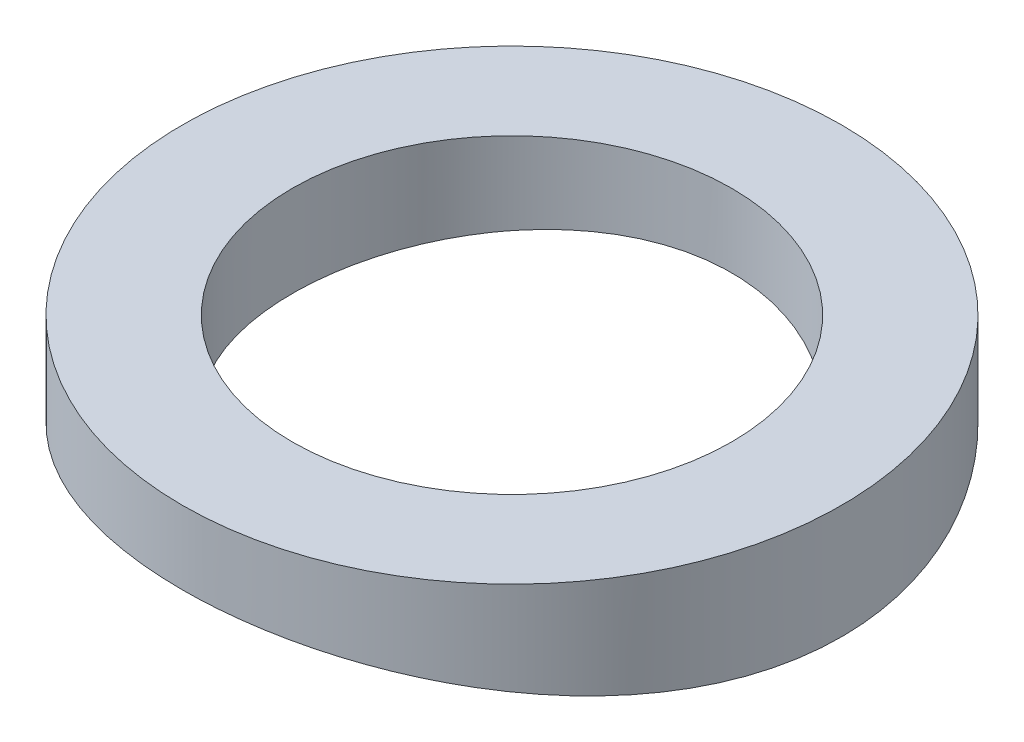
ISO-10303-21;
HEADER;
FILE_DESCRIPTION(('STEP AP214'),'2;1');
FILE_NAME('part.step','',(''),(''),'','','');
FILE_SCHEMA(('AUTOMOTIVE_DESIGN { 1 0 10303 214 1 1 1 1 }'));
ENDSEC;
DATA;
#1=APPLICATION_CONTEXT('core data for automotive mechanical design processes');
#2=APPLICATION_PROTOCOL_DEFINITION('international standard','automotive_design',2000,#1);
#3=PRODUCT_CONTEXT('',#1,'mechanical');
#4=PRODUCT('Part','Part','',(#3));
#5=PRODUCT_RELATED_PRODUCT_CATEGORY('part','',(#4));
#6=PRODUCT_DEFINITION_FORMATION('','',#4);
#7=PRODUCT_DEFINITION_CONTEXT('part definition',#1,'design');
#8=PRODUCT_DEFINITION('design','',#6,#7);
#9=PRODUCT_DEFINITION_SHAPE('','',#8);
#10=(LENGTH_UNIT() NAMED_UNIT(*) SI_UNIT(.MILLI.,.METRE.));
#11=(NAMED_UNIT(*) PLANE_ANGLE_UNIT() SI_UNIT($,.RADIAN.));
#12=(NAMED_UNIT(*) SI_UNIT($,.STERADIAN.) SOLID_ANGLE_UNIT());
#13=UNCERTAINTY_MEASURE_WITH_UNIT(LENGTH_MEASURE(1.E-05),#10,'distance_accuracy_value','');
#14=(GEOMETRIC_REPRESENTATION_CONTEXT(3) GLOBAL_UNCERTAINTY_ASSIGNED_CONTEXT((#13)) GLOBAL_UNIT_ASSIGNED_CONTEXT((#10,
#11,#12)) REPRESENTATION_CONTEXT('',''));
#15=CARTESIAN_POINT('',(0.,0.,0.));
#16=DIRECTION('',(0.,0.,1.));
#17=DIRECTION('',(1.,0.,0.));
#18=AXIS2_PLACEMENT_3D('',#15,#16,#17);
#19=CARTESIAN_POINT('',(0.,6.53689538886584,0.));
#20=DIRECTION('',(0.,1.,0.));
#21=DIRECTION('',(0.,0.,1.));
#22=AXIS2_PLACEMENT_3D('',#19,#20,#21);
#23=CYLINDRICAL_SURFACE('',#22,9.);
#24=CARTESIAN_POINT('',(0.,-1.11128311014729,9.));
#25=CARTESIAN_POINT('',(-0.248924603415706,-1.11127894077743,9.00000702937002));
#26=CARTESIAN_POINT('',(-0.497770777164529,-1.11379896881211,8.98967104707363));
#27=CARTESIAN_POINT('',(-0.993723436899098,-1.12379955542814,8.94842932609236));
#28=CARTESIAN_POINT('',(-1.24082970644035,-1.13128072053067,8.91752107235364));
#29=CARTESIAN_POINT('',(-1.73151881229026,-1.15100456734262,8.83537008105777));
#30=CARTESIAN_POINT('',(-1.97510042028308,-1.16324886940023,8.78412042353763));
#31=CARTESIAN_POINT('',(-2.457028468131,-1.19216474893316,8.66168805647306));
#32=CARTESIAN_POINT('',(-2.69537294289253,-1.20883795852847,8.59049799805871));
#33=CARTESIAN_POINT('',(-3.16470874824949,-1.24612397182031,8.42888632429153));
#34=CARTESIAN_POINT('',(-3.39571097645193,-1.2667305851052,8.338494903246));
#35=CARTESIAN_POINT('',(-3.84928101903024,-1.31135117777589,8.13906835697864));
#36=CARTESIAN_POINT('',(-4.07184563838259,-1.33536643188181,8.03002625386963));
#37=CARTESIAN_POINT('',(-4.5068961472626,-1.3861440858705,7.79417007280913));
#38=CARTESIAN_POINT('',(-4.71938621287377,-1.41290533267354,7.66736344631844));
#39=CARTESIAN_POINT('',(-5.13311775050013,-1.46848441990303,7.39677163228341));
#40=CARTESIAN_POINT('',(-5.33435402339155,-1.4973031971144,7.25297869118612));
#41=CARTESIAN_POINT('',(-5.72762824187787,-1.55674137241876,6.946759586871));
#42=CARTESIAN_POINT('',(-5.91944244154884,-1.58738351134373,6.78405042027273));
#43=CARTESIAN_POINT('',(-6.28866432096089,-1.64914206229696,6.44327467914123));
#44=CARTESIAN_POINT('',(-6.46607818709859,-1.68025826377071,6.26521476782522));
#45=CARTESIAN_POINT('',(-6.80551436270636,-1.74213741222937,5.89475362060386));
#46=CARTESIAN_POINT('',(-6.96752870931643,-1.77290016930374,5.70234505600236));
#47=CARTESIAN_POINT('',(-7.2749148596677,-1.83318857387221,5.30459826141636));
#48=CARTESIAN_POINT('',(-7.42029286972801,-1.86271468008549,5.09926489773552));
#49=CARTESIAN_POINT('',(-7.69543677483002,-1.92011988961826,4.67389888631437));
#50=CARTESIAN_POINT('',(-7.82494760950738,-1.94796914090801,4.45369710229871));
#51=CARTESIAN_POINT('',(-8.06486497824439,-2.00071620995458,4.00288943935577));
#52=CARTESIAN_POINT('',(-8.17527883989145,-2.02561515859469,3.77228759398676));
#53=CARTESIAN_POINT('',(-8.37620967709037,-2.07172504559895,3.30218962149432));
#54=CARTESIAN_POINT('',(-8.46672503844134,-2.09293568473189,3.06269277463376));
#55=CARTESIAN_POINT('',(-8.62710407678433,-2.13101245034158,2.57654531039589));
#56=CARTESIAN_POINT('',(-8.69696822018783,-2.1478786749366,2.32989485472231));
#57=CARTESIAN_POINT('',(-8.81432182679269,-2.1764627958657,1.83600776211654));
#58=CARTESIAN_POINT('',(-8.86221168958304,-2.18827253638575,1.58887155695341));
#59=CARTESIAN_POINT('',(-8.93713788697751,-2.20683963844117,1.09126923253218));
#60=CARTESIAN_POINT('',(-8.964174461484,-2.2135970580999,0.840803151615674));
#61=CARTESIAN_POINT('',(-8.99715626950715,-2.22184915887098,0.338433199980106));
#62=CARTESIAN_POINT('',(-9.00310433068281,-2.22334454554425,0.0865295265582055));
#63=CARTESIAN_POINT('',(-8.99386428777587,-2.22102776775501,-0.416863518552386));
#64=CARTESIAN_POINT('',(-8.97867645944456,-2.21721567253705,-0.668352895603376));
#65=CARTESIAN_POINT('',(-8.92789296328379,-2.20455130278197,-1.1632597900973));
#66=CARTESIAN_POINT('',(-8.89277623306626,-2.1958173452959,-1.40672966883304));
#67=CARTESIAN_POINT('',(-8.80277392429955,-2.17365218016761,-1.88986018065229));
#68=CARTESIAN_POINT('',(-8.74788121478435,-2.16021927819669,-2.12951940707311));
#69=CARTESIAN_POINT('',(-8.6187801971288,-2.12905095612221,-2.60324631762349));
#70=CARTESIAN_POINT('',(-8.54457492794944,-2.11131621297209,-2.83731487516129));
#71=CARTESIAN_POINT('',(-8.37741585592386,-2.07205076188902,-3.29833732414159));
#72=CARTESIAN_POINT('',(-8.28446122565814,-2.05051988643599,-3.52529090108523));
#73=CARTESIAN_POINT('',(-8.07951623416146,-2.00404620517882,-3.97272531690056));
#74=CARTESIAN_POINT('',(-7.96735207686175,-1.97907269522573,-4.19312334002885));
#75=CARTESIAN_POINT('',(-7.72542425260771,-1.92657454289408,-4.62372252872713));
#76=CARTESIAN_POINT('',(-7.5956601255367,-1.89904983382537,-4.83392342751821));
#77=CARTESIAN_POINT('',(-7.31941108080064,-1.8422039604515,-5.24281468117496));
#78=CARTESIAN_POINT('',(-7.17292403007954,-1.81288256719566,-5.44150356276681));
#79=CARTESIAN_POINT('',(-6.86421272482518,-1.75324008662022,-5.82609563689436));
#80=CARTESIAN_POINT('',(-6.70198817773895,-1.72291898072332,-6.01199859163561));
#81=CARTESIAN_POINT('',(-6.3582674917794,-1.66126626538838,-6.37467836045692));
#82=CARTESIAN_POINT('',(-6.1763695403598,-1.62992946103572,-6.55107371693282));
#83=CARTESIAN_POINT('',(-5.7982904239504,-1.56793190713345,-6.88795596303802));
#84=CARTESIAN_POINT('',(-5.60210933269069,-1.53727115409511,-7.04844293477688));
#85=CARTESIAN_POINT('',(-5.19674780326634,-1.4774765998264,-7.35241414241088));
#86=CARTESIAN_POINT('',(-4.98756654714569,-1.44834289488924,-7.49589730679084));
#87=CARTESIAN_POINT('',(-4.55761941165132,-1.392417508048,-7.76481778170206));
#88=CARTESIAN_POINT('',(-4.33685395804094,-1.36562574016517,-7.89025575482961));
#89=CARTESIAN_POINT('',(-3.88446992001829,-1.3150487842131,-8.12254644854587));
#90=CARTESIAN_POINT('',(-3.65281737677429,-1.2912739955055,-8.22933533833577));
#91=CARTESIAN_POINT('',(-3.18106526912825,-1.24752163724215,-8.42293321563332));
#92=CARTESIAN_POINT('',(-2.94096906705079,-1.22754257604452,-8.5097500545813));
#93=CARTESIAN_POINT('',(-2.45395754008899,-1.19194263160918,-8.6627502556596));
#94=CARTESIAN_POINT('',(-2.20704185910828,-1.17632197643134,-8.7289325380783));
#95=CARTESIAN_POINT('',(-1.70823058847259,-1.14989357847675,-8.84009252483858));
#96=CARTESIAN_POINT('',(-1.4563351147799,-1.13908572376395,-8.88507072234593));
#97=CARTESIAN_POINT('',(-0.955631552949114,-1.12279868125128,-8.95259883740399));
#98=CARTESIAN_POINT('',(-0.706897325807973,-1.11719631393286,-8.97566751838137));
#99=CARTESIAN_POINT('',(-0.208311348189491,-1.11102962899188,-9.00105056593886));
#100=CARTESIAN_POINT('',(0.0415403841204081,-1.11046522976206,-9.0033652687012));
#101=CARTESIAN_POINT('',(0.540511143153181,-1.11439010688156,-8.9872216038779));
#102=CARTESIAN_POINT('',(0.789630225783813,-1.1188789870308,-8.96876486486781));
#103=CARTESIAN_POINT('',(1.28533630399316,-1.13278407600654,-8.91123832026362));
#104=CARTESIAN_POINT('',(1.53192330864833,-1.14220026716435,-8.87216858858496));
#105=CARTESIAN_POINT('',(2.01732555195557,-1.16553087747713,-8.77444142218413));
#106=CARTESIAN_POINT('',(2.25620138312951,-1.17937979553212,-8.71606882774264));
#107=CARTESIAN_POINT('',(2.72820735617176,-1.2112443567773,-8.58004835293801));
#108=CARTESIAN_POINT('',(2.96133538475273,-1.22926150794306,-8.5023934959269));
#109=CARTESIAN_POINT('',(3.4201217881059,-1.26897355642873,-8.32844143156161));
#110=CARTESIAN_POINT('',(3.64578236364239,-1.29066735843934,-8.23214977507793));
#111=CARTESIAN_POINT('',(4.08831633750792,-1.33717271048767,-8.02157955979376));
#112=CARTESIAN_POINT('',(4.30518635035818,-1.36198544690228,-7.90729415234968));
#113=CARTESIAN_POINT('',(4.7321790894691,-1.4145050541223,-7.6595309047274));
#114=CARTESIAN_POINT('',(4.94213038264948,-1.44225308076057,-7.52576633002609));
#115=CARTESIAN_POINT('',(5.35016489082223,-1.49956083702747,-7.24138160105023));
#116=CARTESIAN_POINT('',(5.54824269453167,-1.52912138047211,-7.09075384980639));
#117=CARTESIAN_POINT('',(5.93119051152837,-1.58925471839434,-6.77368314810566));
#118=CARTESIAN_POINT('',(6.11605862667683,-1.61982765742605,-6.60723793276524));
#119=CARTESIAN_POINT('',(6.47129595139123,-1.68114707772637,-6.25971604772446));
#120=CARTESIAN_POINT('',(6.64167138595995,-1.71189347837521,-6.07864572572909));
#121=CARTESIAN_POINT('',(6.97075290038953,-1.77346135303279,-5.69853302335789));
#122=CARTESIAN_POINT('',(7.12908867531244,-1.80426747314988,-5.49916734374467));
#123=CARTESIAN_POINT('',(7.42835004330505,-1.86431210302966,-5.08766305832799));
#124=CARTESIAN_POINT('',(7.5692820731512,-1.89355119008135,-4.87552921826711));
#125=CARTESIAN_POINT('',(7.83283746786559,-1.94963458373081,-4.43976539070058));
#126=CARTESIAN_POINT('',(7.95545415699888,-1.97647801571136,-4.21613125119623));
#127=CARTESIAN_POINT('',(8.18134652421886,-2.02695179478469,-3.75905926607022));
#128=CARTESIAN_POINT('',(8.28462994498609,-2.05058342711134,-3.52562539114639));
#129=CARTESIAN_POINT('',(8.47055853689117,-2.09380538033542,-3.05188638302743));
#130=CARTESIAN_POINT('',(8.5533199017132,-2.11341833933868,-2.81162893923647));
#131=CARTESIAN_POINT('',(8.69830009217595,-2.14817507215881,-2.32467397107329));
#132=CARTESIAN_POINT('',(8.7605189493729,-2.16331885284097,-2.07797645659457));
#133=CARTESIAN_POINT('',(8.86387432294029,-2.1886639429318,-1.57999590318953));
#134=CARTESIAN_POINT('',(8.90501446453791,-2.19886610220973,-1.32871366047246));
#135=CARTESIAN_POINT('',(8.96586560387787,-2.2140096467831,-0.823412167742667));
#136=CARTESIAN_POINT('',(8.98557708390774,-2.21895115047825,-0.569392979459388));
#137=CARTESIAN_POINT('',(9.00315413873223,-2.22335629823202,-0.0674717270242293));
#138=CARTESIAN_POINT('',(9.00159885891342,-2.22296516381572,0.180408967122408));
#139=CARTESIAN_POINT('',(8.97805761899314,-2.21706869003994,0.675133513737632));
#140=CARTESIAN_POINT('',(8.95607204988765,-2.21156344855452,0.921977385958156));
#141=CARTESIAN_POINT('',(8.89185766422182,-2.19560466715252,1.41284700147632));
#142=CARTESIAN_POINT('',(8.84962934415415,-2.18515124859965,1.65687281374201));
#143=CARTESIAN_POINT('',(8.74528004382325,-2.15960780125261,2.14038456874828));
#144=CARTESIAN_POINT('',(8.68315896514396,-2.1445177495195,2.37987048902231));
#145=CARTESIAN_POINT('',(8.53992306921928,-2.11024007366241,2.85132890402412));
#146=CARTESIAN_POINT('',(8.45891551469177,-2.09107564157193,3.08333570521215));
#147=CARTESIAN_POINT('',(8.27830921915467,-2.04913969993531,3.53975331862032));
#148=CARTESIAN_POINT('',(8.17870375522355,-2.02636688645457,3.76416134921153));
#149=CARTESIAN_POINT('',(7.96165981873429,-1.9778591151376,4.20381604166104));
#150=CARTESIAN_POINT('',(7.84422307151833,-1.95212444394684,4.41906358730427));
#151=CARTESIAN_POINT('',(7.59232506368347,-1.89839619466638,4.83906698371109));
#152=CARTESIAN_POINT('',(7.45786300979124,-1.87040251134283,5.04382234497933));
#153=CARTESIAN_POINT('',(7.1692835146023,-1.81219819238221,5.4464884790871));
#154=CARTESIAN_POINT('',(7.01476174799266,-1.78194982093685,5.64410413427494));
#155=CARTESIAN_POINT('',(6.68983208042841,-1.72071466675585,6.02569055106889));
#156=CARTESIAN_POINT('',(6.51942394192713,-1.68972787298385,6.2096611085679));
#157=CARTESIAN_POINT('',(6.16380263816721,-1.62786071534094,6.56280002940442));
#158=CARTESIAN_POINT('',(5.97858592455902,-1.59698037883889,6.7319648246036));
#159=CARTESIAN_POINT('',(5.59459357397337,-1.53617815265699,7.0543151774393));
#160=CARTESIAN_POINT('',(5.39581822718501,-1.50625624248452,7.20750107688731));
#161=CARTESIAN_POINT('',(4.98247861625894,-1.44768799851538,7.49933314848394));
#162=CARTESIAN_POINT('',(4.76770214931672,-1.4190723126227,7.63768515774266));
#163=CARTESIAN_POINT('',(4.32699602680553,-1.36449564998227,7.89571321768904));
#164=CARTESIAN_POINT('',(4.10107050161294,-1.33853370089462,8.01539611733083));
#165=CARTESIAN_POINT('',(3.63964941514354,-1.29000249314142,8.23518095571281));
#166=CARTESIAN_POINT('',(3.4041582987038,-1.26743168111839,8.3352918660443));
#167=CARTESIAN_POINT('',(2.92527406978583,-1.22631869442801,8.51517655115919));
#168=CARTESIAN_POINT('',(2.68188220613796,-1.20777588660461,8.59495352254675));
#169=CARTESIAN_POINT('',(2.04026789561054,-1.16546328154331,8.77527792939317));
#170=CARTESIAN_POINT('',(1.63706266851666,-1.14526918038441,8.85940731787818));
#171=CARTESIAN_POINT('',(0.82249994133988,-1.11818298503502,8.9717606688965));
#172=CARTESIAN_POINT('',(0.411142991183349,-1.11128999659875,8.99998838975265));
#173=CARTESIAN_POINT('',(0.,-1.11128311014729,9.));
#174=B_SPLINE_CURVE_WITH_KNOTS('',3,(#24,#25,#26,#27,#28,#29,#30,#31,#32,#33,#34,#35,#36,#37,
#38,#39,#40,#41,#42,#43,#44,#45,#46,#47,#48,#49,#50,#51,#52,#53,#54,#55,#56,#57,#58,#59,#60,#61,
#62,#63,#64,#65,#66,#67,#68,#69,#70,#71,#72,#73,#74,#75,#76,#77,#78,#79,#80,#81,#82,#83,#84,#85,
#86,#87,#88,#89,#90,#91,#92,#93,#94,#95,#96,#97,#98,#99,#100,#101,#102,#103,#104,#105,#106,#107,
#108,#109,#110,#111,#112,#113,#114,#115,#116,#117,#118,#119,#120,#121,#122,#123,#124,#125,#126,
#127,#128,#129,#130,#131,#132,#133,#134,#135,#136,#137,#138,#139,#140,#141,#142,#143,#144,#145,
#146,#147,#148,#149,#150,#151,#152,#153,#154,#155,#156,#157,#158,#159,#160,#161,#162,#163,#164,
#165,#166,#167,#168,#169,#170,#171,#172,#173),.UNSPECIFIED.,.T.,.F.,(4,2,2,2,2,2,2,2,2,2,2,2,2,
2,2,2,2,2,2,2,2,2,2,2,2,2,2,2,2,2,2,2,2,2,2,2,2,2,2,2,2,2,2,2,2,2,2,2,2,2,2,2,2,2,2,2,2,2,2,2,2,
2,2,2,2,2,2,2,2,2,2,2,2,2,4),(0.,0.746411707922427,1.49291468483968,2.23967183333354,
2.98670455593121,3.73257114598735,4.47871740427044,5.2245516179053,5.97072759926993,
6.73001429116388,7.48897304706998,8.24832213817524,9.00738701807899,9.77738627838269,
10.5470894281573,11.3168549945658,12.0866031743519,12.8417065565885,13.5968012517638,
14.351794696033,15.1067782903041,15.8443427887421,16.5821735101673,17.3198881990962,
18.0576354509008,18.8024488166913,19.5472816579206,20.2922096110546,21.0371514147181,
21.8021883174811,22.5672212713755,23.3323024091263,24.0973554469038,24.8649778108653,
25.6322978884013,26.3996581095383,27.1670004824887,27.9156844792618,28.6643563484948,
29.4129695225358,30.1615800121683,30.8996030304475,31.6378934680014,32.3759643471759,
33.1143168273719,33.8649083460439,34.6158393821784,35.3668781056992,36.1175925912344,
36.8860245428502,37.6541714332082,38.4225976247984,39.1907154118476,39.954379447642,
40.7180423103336,41.481573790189,42.245088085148,42.9878524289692,43.7306025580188,
44.4733344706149,45.2160700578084,45.9546859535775,46.6935693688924,47.4323813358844,
48.1712277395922,48.928373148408,49.685529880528,50.4428685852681,51.2001910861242,
51.9704921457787,52.7405099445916,53.5101739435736,54.2797168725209,55.5126306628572,
56.7454615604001),.UNSPECIFIED.);
#175=CARTESIAN_POINT('',(0.,-1.11128311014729,9.));
#176=VERTEX_POINT('',#175);
#177=EDGE_CURVE('E10',#176,#176,#174,.T.);
#178=ORIENTED_EDGE('',*,*,#177,.F.);
#179=EDGE_LOOP('',(#178));
#180=FACE_BOUND('',#179,.T.);
#181=CARTESIAN_POINT('',(0.,0.888716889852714,0.));
#182=DIRECTION('',(0.,1.,0.));
#183=DIRECTION('',(0.,0.,1.));
#184=AXIS2_PLACEMENT_3D('',#181,#182,#183);
#185=CIRCLE('',#184,9.);
#186=CARTESIAN_POINT('',(0.,0.888716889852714,9.));
#187=VERTEX_POINT('',#186);
#188=EDGE_CURVE('E40',#187,#187,#185,.T.);
#189=ORIENTED_EDGE('',*,*,#188,.F.);
#190=EDGE_LOOP('',(#189));
#191=FACE_BOUND('',#190,.T.);
#192=ADVANCED_FACE('F28',(#180,#191),#23,.T.);
#193=CARTESIAN_POINT('',(-9.,0.888716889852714,0.));
#194=DIRECTION('',(0.,1.,0.));
#195=DIRECTION('',(0.,0.,1.));
#196=AXIS2_PLACEMENT_3D('',#193,#194,#195);
#197=PLANE('',#196);
#198=CARTESIAN_POINT('',(0.,0.888716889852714,0.));
#199=DIRECTION('',(0.,1.,0.));
#200=DIRECTION('',(0.,0.,1.));
#201=AXIS2_PLACEMENT_3D('',#198,#199,#200);
#202=CIRCLE('',#201,6.);
#203=CARTESIAN_POINT('',(0.,0.888716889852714,6.));
#204=VERTEX_POINT('',#203);
#205=EDGE_CURVE('E65',#204,#204,#202,.T.);
#206=ORIENTED_EDGE('',*,*,#205,.F.);
#207=EDGE_LOOP('',(#206));
#208=FACE_BOUND('',#207,.T.);
#209=ORIENTED_EDGE('',*,*,#188,.T.);
#210=EDGE_LOOP('',(#209));
#211=FACE_BOUND('',#210,.T.);
#212=ADVANCED_FACE('F52',(#208,#211),#197,.T.);
#213=CARTESIAN_POINT('',(0.,-38.1112831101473,-9.));
#214=DIRECTION('',(0.,0.,1.));
#215=DIRECTION('',(1.,0.,0.));
#216=AXIS2_PLACEMENT_3D('',#213,#214,#215);
#217=CYLINDRICAL_SURFACE('',#216,37.);
#218=CARTESIAN_POINT('',(0.,-1.11128311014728,6.));
#219=CARTESIAN_POINT('',(0.167392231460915,-1.1112820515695,6.0000024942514));
#220=CARTESIAN_POINT('',(0.334750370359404,-1.11242118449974,5.99299274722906));
#221=CARTESIAN_POINT('',(0.668316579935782,-1.1169436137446,5.96501112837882));
#222=CARTESIAN_POINT('',(0.834524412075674,-1.1203273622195,5.94403644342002));
#223=CARTESIAN_POINT('',(1.16465030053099,-1.12924851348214,5.88826259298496));
#224=CARTESIAN_POINT('',(1.3285668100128,-1.13478730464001,5.85345451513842));
#225=CARTESIAN_POINT('',(1.65290139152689,-1.14786515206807,5.77026465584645));
#226=CARTESIAN_POINT('',(1.81331815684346,-1.15540494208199,5.7218778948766));
#227=CARTESIAN_POINT('',(2.12927395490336,-1.17226316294,5.61196379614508));
#228=CARTESIAN_POINT('',(2.2848185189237,-1.18157948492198,5.5504520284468));
#229=CARTESIAN_POINT('',(2.59020577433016,-1.20174149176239,5.41468080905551));
#230=CARTESIAN_POINT('',(2.74004633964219,-1.21258773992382,5.34041665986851));
#231=CARTESIAN_POINT('',(3.03286316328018,-1.23550107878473,5.17973143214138));
#232=CARTESIAN_POINT('',(3.17584283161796,-1.2475675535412,5.09331647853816));
#233=CARTESIAN_POINT('',(3.45409944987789,-1.27259799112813,4.90887654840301));
#234=CARTESIAN_POINT('',(3.58937350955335,-1.28556228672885,4.81084725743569));
#235=CARTESIAN_POINT('',(3.85226397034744,-1.31213019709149,4.60308036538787));
#236=CARTESIAN_POINT('',(3.9798128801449,-1.3257379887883,4.49325789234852));
#237=CARTESIAN_POINT('',(4.22527351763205,-1.35312314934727,4.26325723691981));
#238=CARTESIAN_POINT('',(4.34318166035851,-1.36690057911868,4.14307523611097));
#239=CARTESIAN_POINT('',(4.56846227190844,-1.39422948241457,3.89325492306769));
#240=CARTESIAN_POINT('',(4.67583794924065,-1.40778102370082,3.76361951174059));
#241=CARTESIAN_POINT('',(4.87938555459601,-1.43428571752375,3.49569889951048));
#242=CARTESIAN_POINT('',(4.97555333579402,-1.44723864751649,3.35741052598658));
#243=CARTESIAN_POINT('',(5.1564528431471,-1.47224134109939,3.072399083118));
#244=CARTESIAN_POINT('',(5.24111931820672,-1.48428579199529,2.92563411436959));
#245=CARTESIAN_POINT('',(5.39780593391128,-1.50704891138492,2.62533602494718));
#246=CARTESIAN_POINT('',(5.46982135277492,-1.51776708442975,2.47180040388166));
#247=CARTESIAN_POINT('',(5.60060475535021,-1.53755464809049,2.15914613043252));
#248=CARTESIAN_POINT('',(5.65937829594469,-1.5466247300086,2.000029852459));
#249=CARTESIAN_POINT('',(5.76328751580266,-1.56285985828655,1.67729333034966));
#250=CARTESIAN_POINT('',(5.80841821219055,-1.57002420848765,1.51367146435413));
#251=CARTESIAN_POINT('',(5.92204829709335,-1.58820108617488,1.02080986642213));
#252=CARTESIAN_POINT('',(5.97008041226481,-1.59610025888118,0.68646680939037));
#253=CARTESIAN_POINT('',(6.00942525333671,-1.60255587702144,0.0145638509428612));
#254=CARTESIAN_POINT('',(6.00074177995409,-1.60111294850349,-0.322995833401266));
#255=CARTESIAN_POINT('',(5.92737549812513,-1.58913153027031,-0.98850333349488));
#256=CARTESIAN_POINT('',(5.86323897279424,-1.57868177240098,-1.31651274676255));
#257=CARTESIAN_POINT('',(5.68162374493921,-1.54999862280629,-1.95703957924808));
#258=CARTESIAN_POINT('',(5.56414330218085,-1.53176497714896,-2.26955649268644));
#259=CARTESIAN_POINT('',(5.27862242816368,-1.48947317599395,-2.87188626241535));
#260=CARTESIAN_POINT('',(5.11035382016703,-1.4653888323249,-3.16158905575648));
#261=CARTESIAN_POINT('',(4.72819385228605,-1.41412741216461,-3.70885341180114));
#262=CARTESIAN_POINT('',(4.51429900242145,-1.3869500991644,-3.96641251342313));
#263=CARTESIAN_POINT('',(4.04397512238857,-1.33217437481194,-4.44524362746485));
#264=CARTESIAN_POINT('',(3.78707697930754,-1.30457476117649,-4.66605498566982));
#265=CARTESIAN_POINT('',(3.23962880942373,-1.25235899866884,-5.06150409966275));
#266=CARTESIAN_POINT('',(2.94907858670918,-1.22774286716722,-5.23614158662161));
#267=CARTESIAN_POINT('',(2.34215029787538,-1.18423538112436,-5.53432251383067));
#268=CARTESIAN_POINT('',(2.02575261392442,-1.16534842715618,-5.65782670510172));
#269=CARTESIAN_POINT('',(1.37633145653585,-1.13546305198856,-5.84981527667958));
#270=CARTESIAN_POINT('',(1.04330930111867,-1.12446400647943,-5.91830401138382));
#271=CARTESIAN_POINT('',(0.374064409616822,-1.1116773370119,-5.99769640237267));
#272=CARTESIAN_POINT('',(0.0379185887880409,-1.10978851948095,-6.00923270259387));
#273=CARTESIAN_POINT('',(-0.631504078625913,-1.11515844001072,-5.97607731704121));
#274=CARTESIAN_POINT('',(-0.964781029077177,-1.1224168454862,-5.93138767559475));
#275=CARTESIAN_POINT('',(-1.61706192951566,-1.14520302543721,-5.78757518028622));
#276=CARTESIAN_POINT('',(-1.93613642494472,-1.16068341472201,-5.68876413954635));
#277=CARTESIAN_POINT('',(-2.55319066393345,-1.19818439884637,-5.43984504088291));
#278=CARTESIAN_POINT('',(-2.8511692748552,-1.22020534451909,-5.28973423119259));
#279=CARTESIAN_POINT('',(-3.42033076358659,-1.26859456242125,-4.94101819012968));
#280=CARTESIAN_POINT('',(-3.69126743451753,-1.29499781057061,-4.74201605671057));
#281=CARTESIAN_POINT('',(-4.19612542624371,-1.3491134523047,-4.3017129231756));
#282=CARTESIAN_POINT('',(-4.43004420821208,-1.37682593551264,-4.06040902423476));
#283=CARTESIAN_POINT('',(-4.85655977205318,-1.43076229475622,-3.53952499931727));
#284=CARTESIAN_POINT('',(-5.04873003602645,-1.45696896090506,-3.25959360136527));
#285=CARTESIAN_POINT('',(-5.38331718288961,-1.50460906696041,-2.67103796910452));
#286=CARTESIAN_POINT('',(-5.52573558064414,-1.52604265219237,-2.36241460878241));
#287=CARTESIAN_POINT('',(-5.75613753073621,-1.5615843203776,-1.72651439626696));
#288=CARTESIAN_POINT('',(-5.84433676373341,-1.57572139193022,-1.39931718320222));
#289=CARTESIAN_POINT('',(-5.9644566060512,-1.59513438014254,-0.734318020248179));
#290=CARTESIAN_POINT('',(-5.99638182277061,-1.60041102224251,-0.396516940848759));
#291=CARTESIAN_POINT('',(-6.00135924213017,-1.60123641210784,0.108268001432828));
#292=CARTESIAN_POINT('',(-5.99601020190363,-1.60035365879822,0.275305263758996));
#293=CARTESIAN_POINT('',(-5.97141333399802,-1.59632144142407,0.608308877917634));
#294=CARTESIAN_POINT('',(-5.95217072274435,-1.59317282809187,0.774275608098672));
#295=CARTESIAN_POINT('',(-5.89991810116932,-1.58469481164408,1.10401897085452));
#296=CARTESIAN_POINT('',(-5.86690316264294,-1.57936462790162,1.26779479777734));
#297=CARTESIAN_POINT('',(-5.78737396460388,-1.5666812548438,1.59189480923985));
#298=CARTESIAN_POINT('',(-5.74086457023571,-1.55932879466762,1.75222021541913));
#299=CARTESIAN_POINT('',(-5.63472515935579,-1.54281648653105,2.06824550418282));
#300=CARTESIAN_POINT('',(-5.57510425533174,-1.5336578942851,2.22394851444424));
#301=CARTESIAN_POINT('',(-5.44318333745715,-1.51379412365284,2.52971728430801));
#302=CARTESIAN_POINT('',(-5.37088787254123,-1.50308950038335,2.679785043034));
#303=CARTESIAN_POINT('',(-5.21408995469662,-1.48042808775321,2.97337729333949));
#304=CARTESIAN_POINT('',(-5.12958275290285,-1.46847081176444,3.11689921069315));
#305=CARTESIAN_POINT('',(-4.94900770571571,-1.44364585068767,3.39631922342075));
#306=CARTESIAN_POINT('',(-4.85294393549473,-1.43077848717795,3.53221998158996));
#307=CARTESIAN_POINT('',(-4.64871301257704,-1.40433297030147,3.7970718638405));
#308=CARTESIAN_POINT('',(-4.54041829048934,-1.39074829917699,3.92592398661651));
#309=CARTESIAN_POINT('',(-4.3134429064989,-1.36339516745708,4.17402304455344));
#310=CARTESIAN_POINT('',(-4.1947659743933,-1.34962677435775,4.29327339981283));
#311=CARTESIAN_POINT('',(-3.94773400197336,-1.32227871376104,4.52146959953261));
#312=CARTESIAN_POINT('',(-3.81937322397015,-1.30869916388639,4.63040924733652));
#313=CARTESIAN_POINT('',(-3.55396508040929,-1.28212198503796,4.83710796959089));
#314=CARTESIAN_POINT('',(-3.41692093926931,-1.26912414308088,4.93487115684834));
#315=CARTESIAN_POINT('',(-3.13406955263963,-1.24398186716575,5.11920885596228));
#316=CARTESIAN_POINT('',(-2.98820839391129,-1.23184393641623,5.20570156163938));
#317=CARTESIAN_POINT('',(-2.68966579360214,-1.208869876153,5.36604118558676));
#318=CARTESIAN_POINT('',(-2.53698688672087,-1.19803326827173,5.43989275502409));
#319=CARTESIAN_POINT('',(-2.22594097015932,-1.17797231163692,5.57439425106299));
#320=CARTESIAN_POINT('',(-2.06757806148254,-1.16874682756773,5.63505348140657));
#321=CARTESIAN_POINT('',(-1.74625065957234,-1.15216372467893,5.74276311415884));
#322=CARTESIAN_POINT('',(-1.58328717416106,-1.14480570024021,5.78981647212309));
#323=CARTESIAN_POINT('',(-1.18678023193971,-1.12959510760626,5.886290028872));
#324=CARTESIAN_POINT('',(-0.951501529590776,-1.12275976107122,5.92888146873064));
#325=CARTESIAN_POINT('',(-0.477458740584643,-1.11360455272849,5.98573445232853));
#326=CARTESIAN_POINT('',(-0.238694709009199,-1.11128461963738,5.99999644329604));
#327=CARTESIAN_POINT('',(0.,-1.11128311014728,6.));
#328=B_SPLINE_CURVE_WITH_KNOTS('',3,(#218,#219,#220,#221,#222,#223,#224,#225,#226,#227,#228,
#229,#230,#231,#232,#233,#234,#235,#236,#237,#238,#239,#240,#241,#242,#243,#244,#245,#246,#247,
#248,#249,#250,#251,#252,#253,#254,#255,#256,#257,#258,#259,#260,#261,#262,#263,#264,#265,#266,
#267,#268,#269,#270,#271,#272,#273,#274,#275,#276,#277,#278,#279,#280,#281,#282,#283,#284,#285,
#286,#287,#288,#289,#290,#291,#292,#293,#294,#295,#296,#297,#298,#299,#300,#301,#302,#303,#304,
#305,#306,#307,#308,#309,#310,#311,#312,#313,#314,#315,#316,#317,#318,#319,#320,#321,#322,#323,
#324,#325,#326,#327),.UNSPECIFIED.,.T.,.F.,(4,2,2,2,2,2,2,2,2,2,2,2,2,2,2,2,2,2,2,2,2,2,2,2,2,2,
2,2,2,2,2,2,2,2,2,2,2,2,2,2,2,2,2,2,2,2,2,2,2,2,2,2,2,2,4),(0.,0.501967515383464,
1.00403617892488,1.50642883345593,2.00900596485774,2.51099017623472,3.01315969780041,
3.5150769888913,4.01718131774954,4.52317796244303,5.02936191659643,5.53539118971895,
6.04160709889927,6.55058464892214,7.05975176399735,7.56870481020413,8.07784352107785,
9.08613422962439,10.0943573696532,11.0927599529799,12.0911951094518,13.0941844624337,
14.0972505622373,15.1120723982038,16.126900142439,17.1425054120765,18.1580302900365,
19.162248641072,20.1664304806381,21.1648868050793,22.1633966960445,23.1702971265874,
24.177266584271,25.1940845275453,26.2108715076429,27.2235871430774,28.2362198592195,
28.7371073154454,29.2378068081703,29.7386856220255,30.239384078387,30.7397356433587,
31.2399079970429,31.7402753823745,32.2404668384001,32.7464654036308,33.2522829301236,
33.7584025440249,34.2643353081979,34.773756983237,35.2829908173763,35.7918643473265,
36.3006272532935,37.01642439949,37.7322102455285),.UNSPECIFIED.);
#329=CARTESIAN_POINT('',(0.,-1.11128311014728,6.));
#330=VERTEX_POINT('',#329);
#331=EDGE_CURVE('E32',#330,#330,#328,.T.);
#332=ORIENTED_EDGE('',*,*,#331,.T.);
#333=EDGE_LOOP('',(#332));
#334=FACE_BOUND('',#333,.T.);
#335=ORIENTED_EDGE('',*,*,#177,.T.);
#336=EDGE_LOOP('',(#335));
#337=FACE_BOUND('',#336,.T.);
#338=ADVANCED_FACE('F48',(#334,#337),#217,.F.);
#339=CARTESIAN_POINT('',(0.,-2.74786390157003,0.));
#340=DIRECTION('',(0.,1.,0.));
#341=DIRECTION('',(0.,0.,1.));
#342=AXIS2_PLACEMENT_3D('',#339,#340,#341);
#343=CYLINDRICAL_SURFACE('',#342,6.);
#344=ORIENTED_EDGE('',*,*,#205,.T.);
#345=EDGE_LOOP('',(#344));
#346=FACE_BOUND('',#345,.T.);
#347=ORIENTED_EDGE('',*,*,#331,.F.);
#348=EDGE_LOOP('',(#347));
#349=FACE_BOUND('',#348,.T.);
#350=ADVANCED_FACE('F51',(#346,#349),#343,.F.);
#351=CLOSED_SHELL('',(#192,#212,#338,#350));
#352=MANIFOLD_SOLID_BREP('B2',#351);
#353=ADVANCED_BREP_SHAPE_REPRESENTATION('',(#18,#352),#14);
#354=SHAPE_DEFINITION_REPRESENTATION(#9,#353);
ENDSEC;
END-ISO-10303-21;
